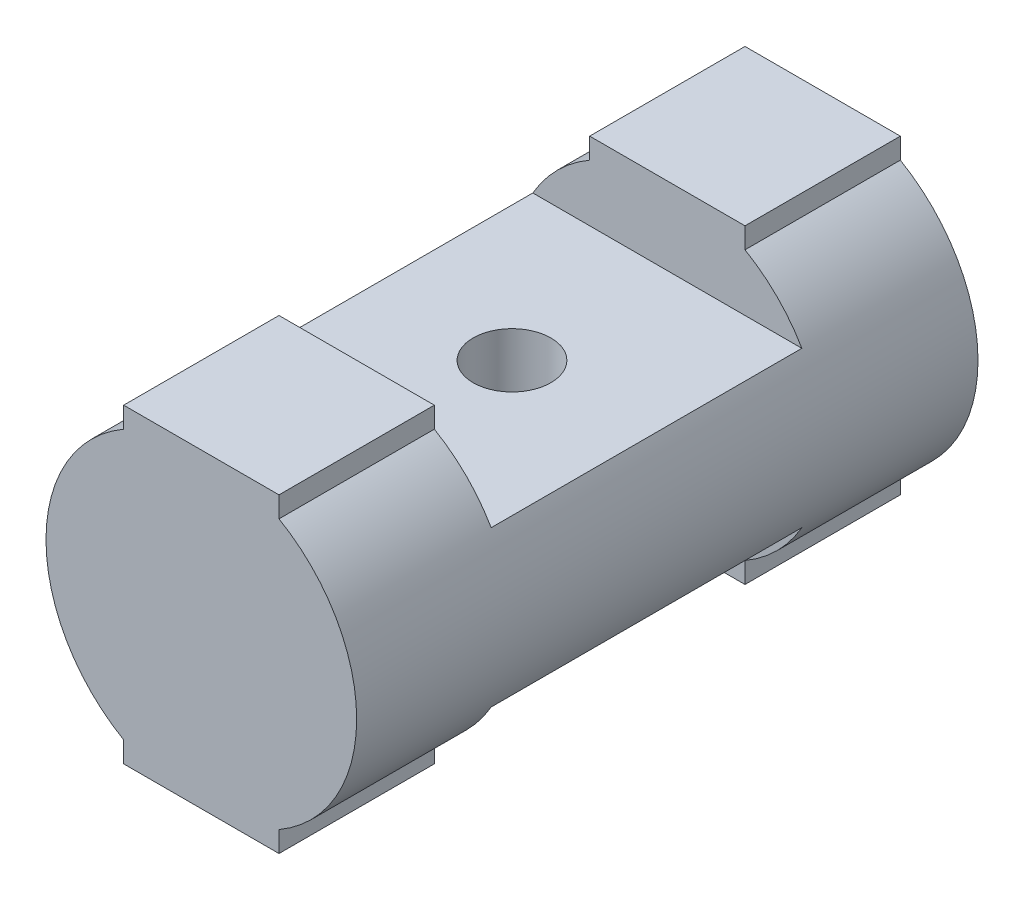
ISO-10303-21;
HEADER;
FILE_DESCRIPTION(('STEP AP214'),'2;1');
FILE_NAME('part.step','',(''),(''),'','','');
FILE_SCHEMA(('AUTOMOTIVE_DESIGN { 1 0 10303 214 1 1 1 1 }'));
ENDSEC;
DATA;
#1=APPLICATION_CONTEXT('core data for automotive mechanical design processes');
#2=APPLICATION_PROTOCOL_DEFINITION('international standard','automotive_design',2000,#1);
#3=PRODUCT_CONTEXT('',#1,'mechanical');
#4=PRODUCT('Part','Part','',(#3));
#5=PRODUCT_RELATED_PRODUCT_CATEGORY('part','',(#4));
#6=PRODUCT_DEFINITION_FORMATION('','',#4);
#7=PRODUCT_DEFINITION_CONTEXT('part definition',#1,'design');
#8=PRODUCT_DEFINITION('design','',#6,#7);
#9=PRODUCT_DEFINITION_SHAPE('','',#8);
#10=(LENGTH_UNIT() NAMED_UNIT(*) SI_UNIT(.MILLI.,.METRE.));
#11=(NAMED_UNIT(*) PLANE_ANGLE_UNIT() SI_UNIT($,.RADIAN.));
#12=(NAMED_UNIT(*) SI_UNIT($,.STERADIAN.) SOLID_ANGLE_UNIT());
#13=UNCERTAINTY_MEASURE_WITH_UNIT(LENGTH_MEASURE(1.E-05),#10,'distance_accuracy_value','');
#14=(GEOMETRIC_REPRESENTATION_CONTEXT(3) GLOBAL_UNCERTAINTY_ASSIGNED_CONTEXT((#13)) GLOBAL_UNIT_ASSIGNED_CONTEXT((#10,
#11,#12)) REPRESENTATION_CONTEXT('',''));
#15=CARTESIAN_POINT('',(0.,0.,0.));
#16=DIRECTION('',(0.,0.,1.));
#17=DIRECTION('',(1.,0.,0.));
#18=AXIS2_PLACEMENT_3D('',#15,#16,#17);
#19=CARTESIAN_POINT('',(0.,0.,20.));
#20=DIRECTION('',(0.,0.,-1.));
#21=DIRECTION('',(-1.,0.,0.));
#22=AXIS2_PLACEMENT_3D('',#19,#20,#21);
#23=CYLINDRICAL_SURFACE('',#22,10.);
#24=CARTESIAN_POINT('',(0.,0.,-10.));
#25=DIRECTION('',(0.,0.,1.));
#26=DIRECTION('',(1.,0.,0.));
#27=AXIS2_PLACEMENT_3D('',#24,#25,#26);
#28=CIRCLE('',#27,10.);
#29=CARTESIAN_POINT('',(-8.66025403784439,-5.,-10.));
#30=VERTEX_POINT('',#29);
#31=CARTESIAN_POINT('',(-5.,-8.66025403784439,-10.));
#32=VERTEX_POINT('',#31);
#33=EDGE_CURVE('E205',#30,#32,#28,.T.);
#34=ORIENTED_EDGE('',*,*,#33,.F.);
#35=DIRECTION('',(0.,0.,1.));
#36=VECTOR('',#35,1.);
#37=CARTESIAN_POINT('',(-8.66025403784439,-5.,-10.));
#38=LINE('',#37,#36);
#39=CARTESIAN_POINT('',(-8.66025403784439,-5.,10.));
#40=VERTEX_POINT('',#39);
#41=EDGE_CURVE('E188',#30,#40,#38,.T.);
#42=ORIENTED_EDGE('',*,*,#41,.T.);
#43=CARTESIAN_POINT('',(0.,0.,10.));
#44=DIRECTION('',(0.,0.,1.));
#45=DIRECTION('',(1.,0.,0.));
#46=AXIS2_PLACEMENT_3D('',#43,#44,#45);
#47=CIRCLE('',#46,10.);
#48=CARTESIAN_POINT('',(-5.,-8.66025403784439,10.));
#49=VERTEX_POINT('',#48);
#50=EDGE_CURVE('E196',#40,#49,#47,.T.);
#51=ORIENTED_EDGE('',*,*,#50,.T.);
#52=DIRECTION('',(0.,0.,-1.));
#53=VECTOR('',#52,1.);
#54=CARTESIAN_POINT('',(-5.,-8.66025403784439,20.));
#55=LINE('',#54,#53);
#56=CARTESIAN_POINT('',(-5.,-8.66025403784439,20.));
#57=VERTEX_POINT('',#56);
#58=EDGE_CURVE('E285',#49,#57,#55,.F.);
#59=ORIENTED_EDGE('',*,*,#58,.T.);
#60=CARTESIAN_POINT('',(0.,0.,20.));
#61=DIRECTION('',(0.,0.,1.));
#62=DIRECTION('',(1.,0.,0.));
#63=AXIS2_PLACEMENT_3D('',#60,#61,#62);
#64=CIRCLE('',#63,10.);
#65=CARTESIAN_POINT('',(-5.,8.66025403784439,20.));
#66=VERTEX_POINT('',#65);
#67=EDGE_CURVE('E297',#66,#57,#64,.T.);
#68=ORIENTED_EDGE('',*,*,#67,.F.);
#69=DIRECTION('',(0.,0.,-1.));
#70=VECTOR('',#69,1.);
#71=CARTESIAN_POINT('',(-5.,8.66025403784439,20.));
#72=LINE('',#71,#70);
#73=CARTESIAN_POINT('',(-5.,8.66025403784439,10.));
#74=VERTEX_POINT('',#73);
#75=EDGE_CURVE('E290',#66,#74,#72,.T.);
#76=ORIENTED_EDGE('',*,*,#75,.T.);
#77=CARTESIAN_POINT('',(0.,0.,10.));
#78=DIRECTION('',(0.,0.,1.));
#79=DIRECTION('',(1.,0.,0.));
#80=AXIS2_PLACEMENT_3D('',#77,#78,#79);
#81=CIRCLE('',#80,10.);
#82=CARTESIAN_POINT('',(-8.66025403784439,5.,10.));
#83=VERTEX_POINT('',#82);
#84=EDGE_CURVE('E226',#74,#83,#81,.T.);
#85=ORIENTED_EDGE('',*,*,#84,.T.);
#86=DIRECTION('',(0.,0.,1.));
#87=VECTOR('',#86,1.);
#88=CARTESIAN_POINT('',(-8.66025403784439,5.,-10.));
#89=LINE('',#88,#87);
#90=CARTESIAN_POINT('',(-8.66025403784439,5.,-10.));
#91=VERTEX_POINT('',#90);
#92=EDGE_CURVE('E213',#91,#83,#89,.T.);
#93=ORIENTED_EDGE('',*,*,#92,.F.);
#94=CARTESIAN_POINT('',(0.,0.,-10.));
#95=DIRECTION('',(0.,0.,1.));
#96=DIRECTION('',(1.,0.,0.));
#97=AXIS2_PLACEMENT_3D('',#94,#95,#96);
#98=CIRCLE('',#97,10.);
#99=CARTESIAN_POINT('',(-5.,8.66025403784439,-10.));
#100=VERTEX_POINT('',#99);
#101=EDGE_CURVE('E234',#100,#91,#98,.T.);
#102=ORIENTED_EDGE('',*,*,#101,.F.);
#103=CARTESIAN_POINT('',(-5.,8.66025403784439,-20.));
#104=VERTEX_POINT('',#103);
#105=EDGE_CURVE('E289',#100,#104,#72,.T.);
#106=ORIENTED_EDGE('',*,*,#105,.T.);
#107=CARTESIAN_POINT('',(0.,0.,-20.));
#108=DIRECTION('',(0.,0.,1.));
#109=DIRECTION('',(1.,0.,0.));
#110=AXIS2_PLACEMENT_3D('',#107,#108,#109);
#111=CIRCLE('',#110,10.);
#112=CARTESIAN_POINT('',(-5.,-8.66025403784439,-20.));
#113=VERTEX_POINT('',#112);
#114=EDGE_CURVE('E298',#104,#113,#111,.T.);
#115=ORIENTED_EDGE('',*,*,#114,.T.);
#116=EDGE_CURVE('E286',#113,#32,#55,.F.);
#117=ORIENTED_EDGE('',*,*,#116,.T.);
#118=EDGE_LOOP('',(#34,#42,#51,#59,#68,#76,#85,#93,#102,#106,#115,#117));
#119=FACE_BOUND('',#118,.T.);
#120=ADVANCED_FACE('F33',(#119),#23,.T.);
#121=CARTESIAN_POINT('',(0.,0.,-10.));
#122=DIRECTION('',(0.,0.,1.));
#123=DIRECTION('',(1.,0.,0.));
#124=AXIS2_PLACEMENT_3D('',#121,#122,#123);
#125=CIRCLE('',#124,10.);
#126=CARTESIAN_POINT('',(5.,-8.66025403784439,-10.));
#127=VERTEX_POINT('',#126);
#128=CARTESIAN_POINT('',(8.66025403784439,-5.,-10.));
#129=VERTEX_POINT('',#128);
#130=EDGE_CURVE('E169',#127,#129,#125,.T.);
#131=ORIENTED_EDGE('',*,*,#130,.F.);
#132=DIRECTION('',(0.,0.,-1.));
#133=VECTOR('',#132,1.);
#134=CARTESIAN_POINT('',(5.,-8.66025403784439,20.));
#135=LINE('',#134,#133);
#136=CARTESIAN_POINT('',(5.,-8.66025403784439,-20.));
#137=VERTEX_POINT('',#136);
#138=EDGE_CURVE('E282',#127,#137,#135,.T.);
#139=ORIENTED_EDGE('',*,*,#138,.T.);
#140=CARTESIAN_POINT('',(5.,8.66025403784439,-20.));
#141=VERTEX_POINT('',#140);
#142=EDGE_CURVE('E293',#137,#141,#111,.T.);
#143=ORIENTED_EDGE('',*,*,#142,.T.);
#144=DIRECTION('',(0.,0.,-1.));
#145=VECTOR('',#144,1.);
#146=CARTESIAN_POINT('',(5.,8.66025403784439,20.));
#147=LINE('',#146,#145);
#148=CARTESIAN_POINT('',(5.,8.66025403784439,-10.));
#149=VERTEX_POINT('',#148);
#150=EDGE_CURVE('E279',#141,#149,#147,.F.);
#151=ORIENTED_EDGE('',*,*,#150,.T.);
#152=CARTESIAN_POINT('',(0.,0.,-10.));
#153=DIRECTION('',(0.,0.,1.));
#154=DIRECTION('',(1.,0.,0.));
#155=AXIS2_PLACEMENT_3D('',#152,#153,#154);
#156=CIRCLE('',#155,10.);
#157=CARTESIAN_POINT('',(8.66025403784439,5.,-10.));
#158=VERTEX_POINT('',#157);
#159=EDGE_CURVE('E229',#158,#149,#156,.T.);
#160=ORIENTED_EDGE('',*,*,#159,.F.);
#161=DIRECTION('',(0.,0.,1.));
#162=VECTOR('',#161,1.);
#163=CARTESIAN_POINT('',(8.66025403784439,5.,-10.));
#164=LINE('',#163,#162);
#165=CARTESIAN_POINT('',(8.66025403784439,5.,10.));
#166=VERTEX_POINT('',#165);
#167=EDGE_CURVE('E217',#158,#166,#164,.T.);
#168=ORIENTED_EDGE('',*,*,#167,.T.);
#169=CARTESIAN_POINT('',(0.,0.,10.));
#170=DIRECTION('',(0.,0.,1.));
#171=DIRECTION('',(1.,0.,0.));
#172=AXIS2_PLACEMENT_3D('',#169,#170,#171);
#173=CIRCLE('',#172,10.);
#174=CARTESIAN_POINT('',(5.,8.66025403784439,10.));
#175=VERTEX_POINT('',#174);
#176=EDGE_CURVE('E220',#166,#175,#173,.T.);
#177=ORIENTED_EDGE('',*,*,#176,.T.);
#178=CARTESIAN_POINT('',(5.,8.66025403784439,20.));
#179=VERTEX_POINT('',#178);
#180=EDGE_CURVE('E278',#175,#179,#147,.F.);
#181=ORIENTED_EDGE('',*,*,#180,.T.);
#182=CARTESIAN_POINT('',(5.,-8.66025403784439,20.));
#183=VERTEX_POINT('',#182);
#184=EDGE_CURVE('E294',#183,#179,#64,.T.);
#185=ORIENTED_EDGE('',*,*,#184,.F.);
#186=CARTESIAN_POINT('',(5.,-8.66025403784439,10.));
#187=VERTEX_POINT('',#186);
#188=EDGE_CURVE('E283',#183,#187,#135,.T.);
#189=ORIENTED_EDGE('',*,*,#188,.T.);
#190=CARTESIAN_POINT('',(0.,0.,10.));
#191=DIRECTION('',(0.,0.,1.));
#192=DIRECTION('',(1.,0.,0.));
#193=AXIS2_PLACEMENT_3D('',#190,#191,#192);
#194=CIRCLE('',#193,10.);
#195=CARTESIAN_POINT('',(8.66025403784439,-5.,10.));
#196=VERTEX_POINT('',#195);
#197=EDGE_CURVE('E194',#187,#196,#194,.T.);
#198=ORIENTED_EDGE('',*,*,#197,.T.);
#199=DIRECTION('',(0.,0.,1.));
#200=VECTOR('',#199,1.);
#201=CARTESIAN_POINT('',(8.66025403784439,-5.,-10.));
#202=LINE('',#201,#200);
#203=EDGE_CURVE('E185',#129,#196,#202,.T.);
#204=ORIENTED_EDGE('',*,*,#203,.F.);
#205=EDGE_LOOP('',(#131,#139,#143,#151,#160,#168,#177,#181,#185,#189,#198,#204));
#206=FACE_BOUND('',#205,.T.);
#207=ADVANCED_FACE('F192',(#206),#23,.T.);
#208=CARTESIAN_POINT('',(5.,-10.,-42.3606797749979));
#209=DIRECTION('',(1.,0.,0.));
#210=DIRECTION('',(0.,0.,-1.));
#211=AXIS2_PLACEMENT_3D('',#208,#209,#210);
#212=PLANE('',#211);
#213=ORIENTED_EDGE('',*,*,#138,.F.);
#214=DIRECTION('',(0.,-1.,0.));
#215=VECTOR('',#214,1.);
#216=CARTESIAN_POINT('',(5.,-10.,-10.));
#217=LINE('',#216,#215);
#218=CARTESIAN_POINT('',(5.,-10.,-10.));
#219=VERTEX_POINT('',#218);
#220=EDGE_CURVE('E175',#127,#219,#217,.T.);
#221=ORIENTED_EDGE('',*,*,#220,.T.);
#222=DIRECTION('',(0.,0.,1.));
#223=VECTOR('',#222,1.);
#224=CARTESIAN_POINT('',(5.,-10.,-42.3606797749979));
#225=LINE('',#224,#223);
#226=CARTESIAN_POINT('',(5.,-10.,-20.));
#227=VERTEX_POINT('',#226);
#228=EDGE_CURVE('E270',#227,#219,#225,.T.);
#229=ORIENTED_EDGE('',*,*,#228,.F.);
#230=DIRECTION('',(0.,-1.,0.));
#231=VECTOR('',#230,1.);
#232=CARTESIAN_POINT('',(5.,-10.,-20.));
#233=LINE('',#232,#231);
#234=EDGE_CURVE('E241',#137,#227,#233,.T.);
#235=ORIENTED_EDGE('',*,*,#234,.F.);
#236=EDGE_LOOP('',(#213,#221,#229,#235));
#237=FACE_BOUND('',#236,.T.);
#238=ADVANCED_FACE('F404',(#237),#212,.T.);
#239=CARTESIAN_POINT('',(5.,-10.,-42.3606797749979));
#240=DIRECTION('',(0.,-1.,0.));
#241=DIRECTION('',(0.,0.,-1.));
#242=AXIS2_PLACEMENT_3D('',#239,#240,#241);
#243=PLANE('',#242);
#244=ORIENTED_EDGE('',*,*,#228,.T.);
#245=DIRECTION('',(-1.,0.,0.));
#246=VECTOR('',#245,1.);
#247=CARTESIAN_POINT('',(8.66025403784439,-10.,-10.));
#248=LINE('',#247,#246);
#249=CARTESIAN_POINT('',(-5.,-10.,-10.));
#250=VERTEX_POINT('',#249);
#251=EDGE_CURVE('E190',#219,#250,#248,.T.);
#252=ORIENTED_EDGE('',*,*,#251,.T.);
#253=DIRECTION('',(0.,0.,1.));
#254=VECTOR('',#253,1.);
#255=CARTESIAN_POINT('',(-5.,-10.,-42.3606797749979));
#256=LINE('',#255,#254);
#257=CARTESIAN_POINT('',(-5.,-10.,-20.));
#258=VERTEX_POINT('',#257);
#259=EDGE_CURVE('E274',#258,#250,#256,.T.);
#260=ORIENTED_EDGE('',*,*,#259,.F.);
#261=DIRECTION('',(-1.,0.,0.));
#262=VECTOR('',#261,1.);
#263=CARTESIAN_POINT('',(5.,-10.,-20.));
#264=LINE('',#263,#262);
#265=EDGE_CURVE('E247',#227,#258,#264,.T.);
#266=ORIENTED_EDGE('',*,*,#265,.F.);
#267=EDGE_LOOP('',(#244,#252,#260,#266));
#268=FACE_BOUND('',#267,.T.);
#269=ADVANCED_FACE('F376',(#268),#243,.T.);
#270=CARTESIAN_POINT('',(-5.,-10.,-42.3606797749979));
#271=DIRECTION('',(-1.,0.,0.));
#272=DIRECTION('',(0.,0.,1.));
#273=AXIS2_PLACEMENT_3D('',#270,#271,#272);
#274=PLANE('',#273);
#275=ORIENTED_EDGE('',*,*,#259,.T.);
#276=DIRECTION('',(0.,1.,0.));
#277=VECTOR('',#276,1.);
#278=CARTESIAN_POINT('',(-5.,-10.,-10.));
#279=LINE('',#278,#277);
#280=EDGE_CURVE('E11',#250,#32,#279,.T.);
#281=ORIENTED_EDGE('',*,*,#280,.T.);
#282=ORIENTED_EDGE('',*,*,#116,.F.);
#283=DIRECTION('',(0.,1.,0.));
#284=VECTOR('',#283,1.);
#285=CARTESIAN_POINT('',(-5.,-10.,-20.));
#286=LINE('',#285,#284);
#287=EDGE_CURVE('E244',#258,#113,#286,.T.);
#288=ORIENTED_EDGE('',*,*,#287,.F.);
#289=EDGE_LOOP('',(#275,#281,#282,#288));
#290=FACE_BOUND('',#289,.T.);
#291=ADVANCED_FACE('F373',(#290),#274,.T.);
#292=ORIENTED_EDGE('',*,*,#105,.F.);
#293=DIRECTION('',(0.,1.,0.));
#294=VECTOR('',#293,1.);
#295=CARTESIAN_POINT('',(-5.,-10.,-10.));
#296=LINE('',#295,#294);
#297=CARTESIAN_POINT('',(-5.,10.,-10.));
#298=VERTEX_POINT('',#297);
#299=EDGE_CURVE('E231',#100,#298,#296,.T.);
#300=ORIENTED_EDGE('',*,*,#299,.T.);
#301=DIRECTION('',(0.,0.,1.));
#302=VECTOR('',#301,1.);
#303=CARTESIAN_POINT('',(-5.,10.,-42.3606797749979));
#304=LINE('',#303,#302);
#305=CARTESIAN_POINT('',(-5.,10.,-20.));
#306=VERTEX_POINT('',#305);
#307=EDGE_CURVE('E262',#306,#298,#304,.T.);
#308=ORIENTED_EDGE('',*,*,#307,.F.);
#309=EDGE_CURVE('E243',#104,#306,#286,.T.);
#310=ORIENTED_EDGE('',*,*,#309,.F.);
#311=EDGE_LOOP('',(#292,#300,#308,#310));
#312=FACE_BOUND('',#311,.T.);
#313=ADVANCED_FACE('F362',(#312),#274,.T.);
#314=CARTESIAN_POINT('',(5.,10.,-42.3606797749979));
#315=DIRECTION('',(0.,1.,0.));
#316=DIRECTION('',(0.,0.,1.));
#317=AXIS2_PLACEMENT_3D('',#314,#315,#316);
#318=PLANE('',#317);
#319=ORIENTED_EDGE('',*,*,#307,.T.);
#320=DIRECTION('',(-1.,0.,0.));
#321=VECTOR('',#320,1.);
#322=CARTESIAN_POINT('',(8.66025403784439,10.,-10.));
#323=LINE('',#322,#321);
#324=CARTESIAN_POINT('',(5.,10.,-10.));
#325=VERTEX_POINT('',#324);
#326=EDGE_CURVE('E211',#325,#298,#323,.T.);
#327=ORIENTED_EDGE('',*,*,#326,.F.);
#328=DIRECTION('',(0.,0.,1.));
#329=VECTOR('',#328,1.);
#330=CARTESIAN_POINT('',(5.,10.,-42.3606797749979));
#331=LINE('',#330,#329);
#332=CARTESIAN_POINT('',(5.,10.,-20.));
#333=VERTEX_POINT('',#332);
#334=EDGE_CURVE('E266',#333,#325,#331,.T.);
#335=ORIENTED_EDGE('',*,*,#334,.F.);
#336=DIRECTION('',(1.,0.,0.));
#337=VECTOR('',#336,1.);
#338=CARTESIAN_POINT('',(5.,10.,-20.));
#339=LINE('',#338,#337);
#340=EDGE_CURVE('E240',#306,#333,#339,.T.);
#341=ORIENTED_EDGE('',*,*,#340,.F.);
#342=EDGE_LOOP('',(#319,#327,#335,#341));
#343=FACE_BOUND('',#342,.T.);
#344=ADVANCED_FACE('F357',(#343),#318,.T.);
#345=ORIENTED_EDGE('',*,*,#334,.T.);
#346=DIRECTION('',(0.,-1.,0.));
#347=VECTOR('',#346,1.);
#348=CARTESIAN_POINT('',(5.,-10.,-10.));
#349=LINE('',#348,#347);
#350=EDGE_CURVE('E302',#325,#149,#349,.T.);
#351=ORIENTED_EDGE('',*,*,#350,.T.);
#352=ORIENTED_EDGE('',*,*,#150,.F.);
#353=EDGE_CURVE('E237',#333,#141,#233,.T.);
#354=ORIENTED_EDGE('',*,*,#353,.F.);
#355=EDGE_LOOP('',(#345,#351,#352,#354));
#356=FACE_BOUND('',#355,.T.);
#357=ADVANCED_FACE('F353',(#356),#212,.T.);
#358=CARTESIAN_POINT('',(0.,0.,20.));
#359=DIRECTION('',(0.,0.,1.));
#360=DIRECTION('',(1.,0.,0.));
#361=AXIS2_PLACEMENT_3D('',#358,#359,#360);
#362=PLANE('',#361);
#363=ORIENTED_EDGE('',*,*,#184,.T.);
#364=DIRECTION('',(0.,1.,0.));
#365=VECTOR('',#364,1.);
#366=CARTESIAN_POINT('',(5.,-10.,20.));
#367=LINE('',#366,#365);
#368=CARTESIAN_POINT('',(5.,10.,20.));
#369=VERTEX_POINT('',#368);
#370=EDGE_CURVE('E254',#179,#369,#367,.T.);
#371=ORIENTED_EDGE('',*,*,#370,.T.);
#372=DIRECTION('',(-1.,0.,0.));
#373=VECTOR('',#372,1.);
#374=CARTESIAN_POINT('',(5.,10.,20.));
#375=LINE('',#374,#373);
#376=CARTESIAN_POINT('',(-5.,10.,20.));
#377=VERTEX_POINT('',#376);
#378=EDGE_CURVE('E258',#369,#377,#375,.T.);
#379=ORIENTED_EDGE('',*,*,#378,.T.);
#380=DIRECTION('',(0.,-1.,0.));
#381=VECTOR('',#380,1.);
#382=CARTESIAN_POINT('',(-5.,-10.,20.));
#383=LINE('',#382,#381);
#384=EDGE_CURVE('E248',#377,#66,#383,.T.);
#385=ORIENTED_EDGE('',*,*,#384,.T.);
#386=ORIENTED_EDGE('',*,*,#67,.T.);
#387=CARTESIAN_POINT('',(-5.,-10.,20.));
#388=VERTEX_POINT('',#387);
#389=EDGE_CURVE('E236',#57,#388,#383,.T.);
#390=ORIENTED_EDGE('',*,*,#389,.T.);
#391=DIRECTION('',(1.,0.,0.));
#392=VECTOR('',#391,1.);
#393=CARTESIAN_POINT('',(5.,-10.,20.));
#394=LINE('',#393,#392);
#395=CARTESIAN_POINT('',(5.,-10.,20.));
#396=VERTEX_POINT('',#395);
#397=EDGE_CURVE('E251',#388,#396,#394,.T.);
#398=ORIENTED_EDGE('',*,*,#397,.T.);
#399=EDGE_CURVE('E255',#396,#183,#367,.T.);
#400=ORIENTED_EDGE('',*,*,#399,.T.);
#401=EDGE_LOOP('',(#363,#371,#379,#385,#386,#390,#398,#400));
#402=FACE_BOUND('',#401,.T.);
#403=ADVANCED_FACE('F316',(#402),#362,.T.);
#404=CARTESIAN_POINT('',(0.,0.,-20.));
#405=DIRECTION('',(0.,0.,1.));
#406=DIRECTION('',(1.,0.,0.));
#407=AXIS2_PLACEMENT_3D('',#404,#405,#406);
#408=PLANE('',#407);
#409=ORIENTED_EDGE('',*,*,#142,.F.);
#410=ORIENTED_EDGE('',*,*,#234,.T.);
#411=ORIENTED_EDGE('',*,*,#265,.T.);
#412=ORIENTED_EDGE('',*,*,#287,.T.);
#413=ORIENTED_EDGE('',*,*,#114,.F.);
#414=ORIENTED_EDGE('',*,*,#309,.T.);
#415=ORIENTED_EDGE('',*,*,#340,.T.);
#416=ORIENTED_EDGE('',*,*,#353,.T.);
#417=EDGE_LOOP('',(#409,#410,#411,#412,#413,#414,#415,#416));
#418=FACE_BOUND('',#417,.T.);
#419=ADVANCED_FACE('F368',(#418),#408,.F.);
#420=DIRECTION('',(0.,-1.,0.));
#421=VECTOR('',#420,1.);
#422=CARTESIAN_POINT('',(5.,-10.,10.));
#423=LINE('',#422,#421);
#424=CARTESIAN_POINT('',(5.,-10.,10.));
#425=VERTEX_POINT('',#424);
#426=EDGE_CURVE('E202',#187,#425,#423,.T.);
#427=ORIENTED_EDGE('',*,*,#426,.F.);
#428=ORIENTED_EDGE('',*,*,#188,.F.);
#429=ORIENTED_EDGE('',*,*,#399,.F.);
#430=EDGE_CURVE('E273',#425,#396,#225,.T.);
#431=ORIENTED_EDGE('',*,*,#430,.F.);
#432=EDGE_LOOP('',(#427,#428,#429,#431));
#433=FACE_BOUND('',#432,.T.);
#434=ADVANCED_FACE('F323',(#433),#212,.T.);
#435=DIRECTION('',(-1.,0.,0.));
#436=VECTOR('',#435,1.);
#437=CARTESIAN_POINT('',(8.66025403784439,-10.,10.));
#438=LINE('',#437,#436);
#439=CARTESIAN_POINT('',(-5.,-10.,10.));
#440=VERTEX_POINT('',#439);
#441=EDGE_CURVE('E48',#425,#440,#438,.T.);
#442=ORIENTED_EDGE('',*,*,#441,.F.);
#443=ORIENTED_EDGE('',*,*,#430,.T.);
#444=ORIENTED_EDGE('',*,*,#397,.F.);
#445=EDGE_CURVE('E261',#440,#388,#256,.T.);
#446=ORIENTED_EDGE('',*,*,#445,.F.);
#447=EDGE_LOOP('',(#442,#443,#444,#446));
#448=FACE_BOUND('',#447,.T.);
#449=ADVANCED_FACE('F319',(#448),#243,.T.);
#450=DIRECTION('',(0.,1.,0.));
#451=VECTOR('',#450,1.);
#452=CARTESIAN_POINT('',(-5.,-10.,10.));
#453=LINE('',#452,#451);
#454=EDGE_CURVE('E41',#440,#49,#453,.T.);
#455=ORIENTED_EDGE('',*,*,#454,.F.);
#456=ORIENTED_EDGE('',*,*,#445,.T.);
#457=ORIENTED_EDGE('',*,*,#389,.F.);
#458=ORIENTED_EDGE('',*,*,#58,.F.);
#459=EDGE_LOOP('',(#455,#456,#457,#458));
#460=FACE_BOUND('',#459,.T.);
#461=ADVANCED_FACE('F312',(#460),#274,.T.);
#462=DIRECTION('',(0.,1.,0.));
#463=VECTOR('',#462,1.);
#464=CARTESIAN_POINT('',(-5.,-10.,10.));
#465=LINE('',#464,#463);
#466=CARTESIAN_POINT('',(-5.,10.,10.));
#467=VERTEX_POINT('',#466);
#468=EDGE_CURVE('E224',#74,#467,#465,.T.);
#469=ORIENTED_EDGE('',*,*,#468,.F.);
#470=ORIENTED_EDGE('',*,*,#75,.F.);
#471=ORIENTED_EDGE('',*,*,#384,.F.);
#472=EDGE_CURVE('E265',#467,#377,#304,.T.);
#473=ORIENTED_EDGE('',*,*,#472,.F.);
#474=EDGE_LOOP('',(#469,#470,#471,#473));
#475=FACE_BOUND('',#474,.T.);
#476=ADVANCED_FACE('F339',(#475),#274,.T.);
#477=DIRECTION('',(-1.,0.,0.));
#478=VECTOR('',#477,1.);
#479=CARTESIAN_POINT('',(8.66025403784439,10.,10.));
#480=LINE('',#479,#478);
#481=CARTESIAN_POINT('',(5.,10.,10.));
#482=VERTEX_POINT('',#481);
#483=EDGE_CURVE('E56',#482,#467,#480,.T.);
#484=ORIENTED_EDGE('',*,*,#483,.T.);
#485=ORIENTED_EDGE('',*,*,#472,.T.);
#486=ORIENTED_EDGE('',*,*,#378,.F.);
#487=EDGE_CURVE('E269',#482,#369,#331,.T.);
#488=ORIENTED_EDGE('',*,*,#487,.F.);
#489=EDGE_LOOP('',(#484,#485,#486,#488));
#490=FACE_BOUND('',#489,.T.);
#491=ADVANCED_FACE('F333',(#490),#318,.T.);
#492=DIRECTION('',(0.,-1.,0.));
#493=VECTOR('',#492,1.);
#494=CARTESIAN_POINT('',(5.,-10.,10.));
#495=LINE('',#494,#493);
#496=EDGE_CURVE('E300',#482,#175,#495,.T.);
#497=ORIENTED_EDGE('',*,*,#496,.F.);
#498=ORIENTED_EDGE('',*,*,#487,.T.);
#499=ORIENTED_EDGE('',*,*,#370,.F.);
#500=ORIENTED_EDGE('',*,*,#180,.F.);
#501=EDGE_LOOP('',(#497,#498,#499,#500));
#502=FACE_BOUND('',#501,.T.);
#503=ADVANCED_FACE('F330',(#502),#212,.T.);
#504=CARTESIAN_POINT('',(0.,0.,-10.));
#505=DIRECTION('',(0.,0.,1.));
#506=DIRECTION('',(1.,0.,0.));
#507=AXIS2_PLACEMENT_3D('',#504,#505,#506);
#508=PLANE('',#507);
#509=ORIENTED_EDGE('',*,*,#101,.T.);
#510=DIRECTION('',(1.,0.,0.));
#511=VECTOR('',#510,1.);
#512=CARTESIAN_POINT('',(8.66025403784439,5.,-10.));
#513=LINE('',#512,#511);
#514=EDGE_CURVE('E208',#91,#158,#513,.T.);
#515=ORIENTED_EDGE('',*,*,#514,.T.);
#516=ORIENTED_EDGE('',*,*,#159,.T.);
#517=ORIENTED_EDGE('',*,*,#350,.F.);
#518=ORIENTED_EDGE('',*,*,#326,.T.);
#519=ORIENTED_EDGE('',*,*,#299,.F.);
#520=EDGE_LOOP('',(#509,#515,#516,#517,#518,#519));
#521=FACE_BOUND('',#520,.T.);
#522=ADVANCED_FACE('F350',(#521),#508,.T.);
#523=CARTESIAN_POINT('',(0.,0.,10.));
#524=DIRECTION('',(0.,0.,1.));
#525=DIRECTION('',(1.,0.,0.));
#526=AXIS2_PLACEMENT_3D('',#523,#524,#525);
#527=PLANE('',#526);
#528=ORIENTED_EDGE('',*,*,#468,.T.);
#529=ORIENTED_EDGE('',*,*,#483,.F.);
#530=ORIENTED_EDGE('',*,*,#496,.T.);
#531=ORIENTED_EDGE('',*,*,#176,.F.);
#532=DIRECTION('',(1.,0.,0.));
#533=VECTOR('',#532,1.);
#534=CARTESIAN_POINT('',(8.66025403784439,5.,10.));
#535=LINE('',#534,#533);
#536=EDGE_CURVE('E179',#83,#166,#535,.T.);
#537=ORIENTED_EDGE('',*,*,#536,.F.);
#538=ORIENTED_EDGE('',*,*,#84,.F.);
#539=EDGE_LOOP('',(#528,#529,#530,#531,#537,#538));
#540=FACE_BOUND('',#539,.T.);
#541=ADVANCED_FACE('F343',(#540),#527,.F.);
#542=CARTESIAN_POINT('',(8.66025403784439,5.,-10.));
#543=DIRECTION('',(0.,-1.,0.));
#544=DIRECTION('',(0.,0.,-1.));
#545=AXIS2_PLACEMENT_3D('',#542,#543,#544);
#546=PLANE('',#545);
#547=CARTESIAN_POINT('',(0.,5.,0.));
#548=DIRECTION('',(0.,1.,0.));
#549=DIRECTION('',(0.,0.,1.));
#550=AXIS2_PLACEMENT_3D('',#547,#548,#549);
#551=CIRCLE('',#550,2.5);
#552=CARTESIAN_POINT('',(0.,5.,2.5));
#553=VERTEX_POINT('',#552);
#554=EDGE_CURVE('E381',#553,#553,#551,.T.);
#555=ORIENTED_EDGE('',*,*,#554,.F.);
#556=EDGE_LOOP('',(#555));
#557=FACE_BOUND('',#556,.T.);
#558=ORIENTED_EDGE('',*,*,#536,.T.);
#559=ORIENTED_EDGE('',*,*,#167,.F.);
#560=ORIENTED_EDGE('',*,*,#514,.F.);
#561=ORIENTED_EDGE('',*,*,#92,.T.);
#562=EDGE_LOOP('',(#558,#559,#560,#561));
#563=FACE_BOUND('',#562,.T.);
#564=ADVANCED_FACE('F345',(#557,#563),#546,.F.);
#565=CARTESIAN_POINT('',(0.,0.,-10.));
#566=DIRECTION('',(0.,0.,1.));
#567=DIRECTION('',(1.,0.,0.));
#568=AXIS2_PLACEMENT_3D('',#565,#566,#567);
#569=PLANE('',#568);
#570=ORIENTED_EDGE('',*,*,#130,.T.);
#571=DIRECTION('',(1.,0.,0.));
#572=VECTOR('',#571,1.);
#573=CARTESIAN_POINT('',(8.66025403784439,-5.,-10.));
#574=LINE('',#573,#572);
#575=EDGE_CURVE('E172',#30,#129,#574,.T.);
#576=ORIENTED_EDGE('',*,*,#575,.F.);
#577=ORIENTED_EDGE('',*,*,#33,.T.);
#578=ORIENTED_EDGE('',*,*,#280,.F.);
#579=ORIENTED_EDGE('',*,*,#251,.F.);
#580=ORIENTED_EDGE('',*,*,#220,.F.);
#581=EDGE_LOOP('',(#570,#576,#577,#578,#579,#580));
#582=FACE_BOUND('',#581,.T.);
#583=ADVANCED_FACE('F171',(#582),#569,.T.);
#584=CARTESIAN_POINT('',(0.,0.,10.));
#585=DIRECTION('',(0.,0.,1.));
#586=DIRECTION('',(1.,0.,0.));
#587=AXIS2_PLACEMENT_3D('',#584,#585,#586);
#588=PLANE('',#587);
#589=ORIENTED_EDGE('',*,*,#426,.T.);
#590=ORIENTED_EDGE('',*,*,#441,.T.);
#591=ORIENTED_EDGE('',*,*,#454,.T.);
#592=ORIENTED_EDGE('',*,*,#50,.F.);
#593=DIRECTION('',(1.,0.,0.));
#594=VECTOR('',#593,1.);
#595=CARTESIAN_POINT('',(8.66025403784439,-5.,10.));
#596=LINE('',#595,#594);
#597=EDGE_CURVE('E378',#40,#196,#596,.T.);
#598=ORIENTED_EDGE('',*,*,#597,.T.);
#599=ORIENTED_EDGE('',*,*,#197,.F.);
#600=EDGE_LOOP('',(#589,#590,#591,#592,#598,#599));
#601=FACE_BOUND('',#600,.T.);
#602=ADVANCED_FACE('F305',(#601),#588,.F.);
#603=CARTESIAN_POINT('',(8.66025403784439,-5.,-10.));
#604=DIRECTION('',(0.,-1.,0.));
#605=DIRECTION('',(0.,0.,-1.));
#606=AXIS2_PLACEMENT_3D('',#603,#604,#605);
#607=PLANE('',#606);
#608=CARTESIAN_POINT('',(0.,-5.,0.));
#609=DIRECTION('',(0.,-1.,0.));
#610=DIRECTION('',(0.,0.,-1.));
#611=AXIS2_PLACEMENT_3D('',#608,#609,#610);
#612=CIRCLE('',#611,2.5);
#613=CARTESIAN_POINT('',(0.,-5.,-2.5));
#614=VERTEX_POINT('',#613);
#615=EDGE_CURVE('E36',#614,#614,#612,.T.);
#616=ORIENTED_EDGE('',*,*,#615,.F.);
#617=EDGE_LOOP('',(#616));
#618=FACE_BOUND('',#617,.T.);
#619=ORIENTED_EDGE('',*,*,#597,.F.);
#620=ORIENTED_EDGE('',*,*,#41,.F.);
#621=ORIENTED_EDGE('',*,*,#575,.T.);
#622=ORIENTED_EDGE('',*,*,#203,.T.);
#623=EDGE_LOOP('',(#619,#620,#621,#622));
#624=FACE_BOUND('',#623,.T.);
#625=ADVANCED_FACE('F184',(#618,#624),#607,.T.);
#626=CARTESIAN_POINT('',(0.,-10.,0.));
#627=DIRECTION('',(0.,1.,0.));
#628=DIRECTION('',(0.,0.,1.));
#629=AXIS2_PLACEMENT_3D('',#626,#627,#628);
#630=CYLINDRICAL_SURFACE('',#629,2.5);
#631=ORIENTED_EDGE('',*,*,#615,.T.);
#632=EDGE_LOOP('',(#631));
#633=FACE_BOUND('',#632,.T.);
#634=ORIENTED_EDGE('',*,*,#554,.T.);
#635=EDGE_LOOP('',(#634));
#636=FACE_BOUND('',#635,.T.);
#637=ADVANCED_FACE('F389',(#633,#636),#630,.F.);
#638=CLOSED_SHELL('',(#120,#207,#238,#269,#291,#313,#344,#357,#403,#419,#434,#449,#461,#476,
#491,#503,#522,#541,#564,#583,#602,#625,#637));
#639=MANIFOLD_SOLID_BREP('B2',#638);
#640=ADVANCED_BREP_SHAPE_REPRESENTATION('',(#18,#639),#14);
#641=SHAPE_DEFINITION_REPRESENTATION(#9,#640);
ENDSEC;
END-ISO-10303-21;
